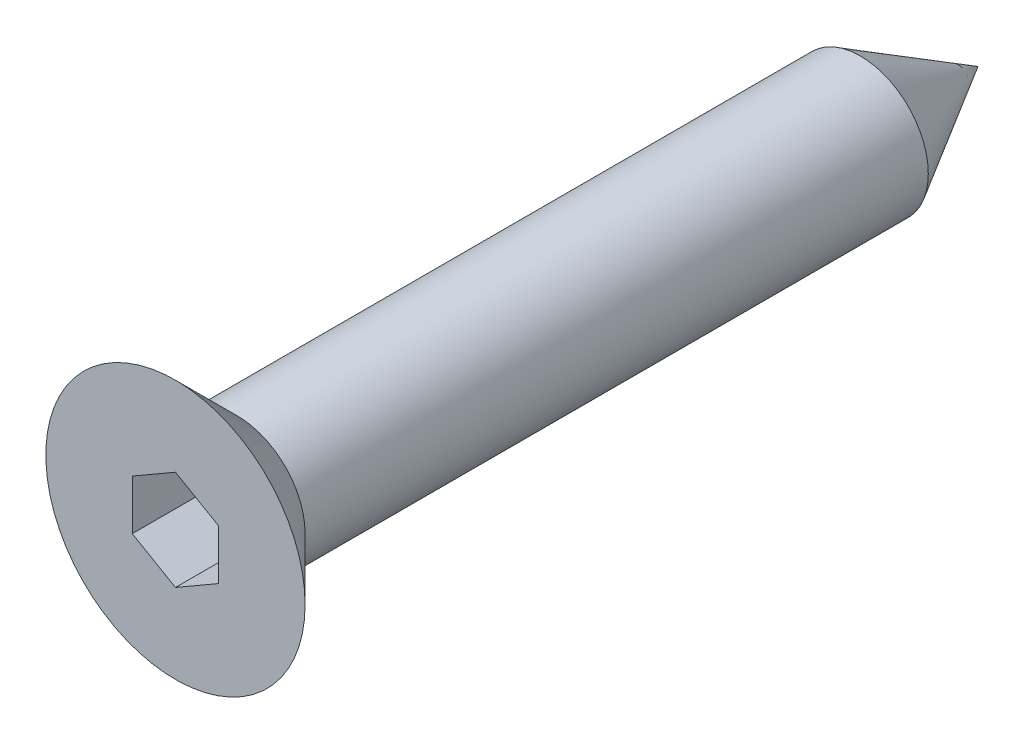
ISO-10303-21;
HEADER;
FILE_DESCRIPTION(('STEP AP214'),'2;1');
FILE_NAME('part.step','',(''),(''),'','','');
FILE_SCHEMA(('AUTOMOTIVE_DESIGN { 1 0 10303 214 1 1 1 1 }'));
ENDSEC;
DATA;
#1=APPLICATION_CONTEXT('core data for automotive mechanical design processes');
#2=APPLICATION_PROTOCOL_DEFINITION('international standard','automotive_design',2000,#1);
#3=PRODUCT_CONTEXT('',#1,'mechanical');
#4=PRODUCT('Part','Part','',(#3));
#5=PRODUCT_RELATED_PRODUCT_CATEGORY('part','',(#4));
#6=PRODUCT_DEFINITION_FORMATION('','',#4);
#7=PRODUCT_DEFINITION_CONTEXT('part definition',#1,'design');
#8=PRODUCT_DEFINITION('design','',#6,#7);
#9=PRODUCT_DEFINITION_SHAPE('','',#8);
#10=(LENGTH_UNIT() NAMED_UNIT(*) SI_UNIT(.MILLI.,.METRE.));
#11=(NAMED_UNIT(*) PLANE_ANGLE_UNIT() SI_UNIT($,.RADIAN.));
#12=(NAMED_UNIT(*) SI_UNIT($,.STERADIAN.) SOLID_ANGLE_UNIT());
#13=UNCERTAINTY_MEASURE_WITH_UNIT(LENGTH_MEASURE(1.E-05),#10,'distance_accuracy_value','');
#14=(GEOMETRIC_REPRESENTATION_CONTEXT(3) GLOBAL_UNCERTAINTY_ASSIGNED_CONTEXT((#13)) GLOBAL_UNIT_ASSIGNED_CONTEXT((#10,
#11,#12)) REPRESENTATION_CONTEXT('',''));
#15=CARTESIAN_POINT('',(0.,0.,0.));
#16=DIRECTION('',(0.,0.,1.));
#17=DIRECTION('',(1.,0.,0.));
#18=AXIS2_PLACEMENT_3D('',#15,#16,#17);
#19=CARTESIAN_POINT('',(0.,2.1,0.));
#20=DIRECTION('',(0.,0.,-1.));
#21=DIRECTION('',(-1.,0.,0.));
#22=AXIS2_PLACEMENT_3D('',#19,#20,#21);
#23=PLANE('',#22);
#24=DIRECTION('',(-0.866025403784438,-0.5,0.));
#25=VECTOR('',#24,1.);
#26=CARTESIAN_POINT('',(0.,0.808290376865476,0.));
#27=LINE('',#26,#25);
#28=CARTESIAN_POINT('',(0.,0.808290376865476,0.));
#29=VERTEX_POINT('',#28);
#30=CARTESIAN_POINT('',(-0.7,0.404145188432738,0.));
#31=VERTEX_POINT('',#30);
#32=EDGE_CURVE('E119',#29,#31,#27,.T.);
#33=ORIENTED_EDGE('',*,*,#32,.F.);
#34=DIRECTION('',(-0.866025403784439,0.5,0.));
#35=VECTOR('',#34,1.);
#36=CARTESIAN_POINT('',(0.699999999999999,0.404145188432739,0.));
#37=LINE('',#36,#35);
#38=CARTESIAN_POINT('',(0.699999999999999,0.404145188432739,0.));
#39=VERTEX_POINT('',#38);
#40=EDGE_CURVE('E49',#39,#29,#37,.T.);
#41=ORIENTED_EDGE('',*,*,#40,.F.);
#42=DIRECTION('',(0.,1.,0.));
#43=VECTOR('',#42,1.);
#44=CARTESIAN_POINT('',(0.7,-0.404145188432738,0.));
#45=LINE('',#44,#43);
#46=CARTESIAN_POINT('',(0.7,-0.404145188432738,0.));
#47=VERTEX_POINT('',#46);
#48=EDGE_CURVE('E105',#47,#39,#45,.T.);
#49=ORIENTED_EDGE('',*,*,#48,.F.);
#50=DIRECTION('',(0.866025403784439,0.5,0.));
#51=VECTOR('',#50,1.);
#52=CARTESIAN_POINT('',(0.,-0.808290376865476,0.));
#53=LINE('',#52,#51);
#54=CARTESIAN_POINT('',(0.,-0.808290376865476,0.));
#55=VERTEX_POINT('',#54);
#56=EDGE_CURVE('E108',#55,#47,#53,.T.);
#57=ORIENTED_EDGE('',*,*,#56,.F.);
#58=DIRECTION('',(0.866025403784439,-0.5,0.));
#59=VECTOR('',#58,1.);
#60=CARTESIAN_POINT('',(-0.7,-0.404145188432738,0.));
#61=LINE('',#60,#59);
#62=CARTESIAN_POINT('',(-0.7,-0.404145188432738,0.));
#63=VERTEX_POINT('',#62);
#64=EDGE_CURVE('E124',#63,#55,#61,.T.);
#65=ORIENTED_EDGE('',*,*,#64,.F.);
#66=DIRECTION('',(0.,-1.,0.));
#67=VECTOR('',#66,1.);
#68=CARTESIAN_POINT('',(-0.7,0.404145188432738,0.));
#69=LINE('',#68,#67);
#70=EDGE_CURVE('E121',#31,#63,#69,.T.);
#71=ORIENTED_EDGE('',*,*,#70,.F.);
#72=EDGE_LOOP('',(#33,#41,#49,#57,#65,#71));
#73=FACE_BOUND('',#72,.T.);
#74=CARTESIAN_POINT('',(0.,0.,0.));
#75=DIRECTION('',(0.,0.,1.));
#76=DIRECTION('',(1.,0.,0.));
#77=AXIS2_PLACEMENT_3D('',#74,#75,#76);
#78=CIRCLE('',#77,2.1);
#79=CARTESIAN_POINT('',(2.1,0.,0.));
#80=VERTEX_POINT('',#79);
#81=EDGE_CURVE('E42',#80,#80,#78,.T.);
#82=ORIENTED_EDGE('',*,*,#81,.T.);
#83=EDGE_LOOP('',(#82));
#84=FACE_BOUND('',#83,.T.);
#85=ADVANCED_FACE('F33',(#73,#84),#23,.F.);
#86=CARTESIAN_POINT('',(0.,0.,-1.));
#87=DIRECTION('',(0.,0.,1.));
#88=DIRECTION('',(1.,0.,0.));
#89=AXIS2_PLACEMENT_3D('',#86,#87,#88);
#90=CONICAL_SURFACE('',#89,1.1,0.785398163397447);
#91=ORIENTED_EDGE('',*,*,#81,.F.);
#92=EDGE_LOOP('',(#91));
#93=FACE_BOUND('',#92,.T.);
#94=CARTESIAN_POINT('',(0.,0.,-1.));
#95=DIRECTION('',(0.,0.,1.));
#96=DIRECTION('',(1.,0.,0.));
#97=AXIS2_PLACEMENT_3D('',#94,#95,#96);
#98=CIRCLE('',#97,1.1);
#99=CARTESIAN_POINT('',(1.1,0.,-1.));
#100=VERTEX_POINT('',#99);
#101=EDGE_CURVE('E131',#100,#100,#98,.T.);
#102=ORIENTED_EDGE('',*,*,#101,.T.);
#103=EDGE_LOOP('',(#102));
#104=FACE_BOUND('',#103,.T.);
#105=ADVANCED_FACE('F144',(#93,#104),#90,.T.);
#106=CARTESIAN_POINT('',(0.,0.,-13.));
#107=DIRECTION('',(0.,0.,1.));
#108=DIRECTION('',(1.,0.,0.));
#109=AXIS2_PLACEMENT_3D('',#106,#107,#108);
#110=CYLINDRICAL_SURFACE('',#109,1.1);
#111=CARTESIAN_POINT('',(0.,0.,-11.0947441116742));
#112=DIRECTION('',(0.,0.,1.));
#113=DIRECTION('',(1.,0.,0.));
#114=AXIS2_PLACEMENT_3D('',#111,#112,#113);
#115=CIRCLE('',#114,1.1);
#116=CARTESIAN_POINT('',(1.1,0.,-11.0947441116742));
#117=VERTEX_POINT('',#116);
#118=EDGE_CURVE('E11',#117,#117,#115,.T.);
#119=CARTESIAN_POINT('',(1.1,0.,-11.0947441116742));
#120=CARTESIAN_POINT('',(1.1,0.,-10.9895905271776));
#121=CARTESIAN_POINT('',(1.1,0.,-10.884436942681));
#122=CARTESIAN_POINT('',(1.1,0.,-10.6741297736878));
#123=CARTESIAN_POINT('',(1.1,0.,-10.5689761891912));
#124=CARTESIAN_POINT('',(1.1,0.,-10.358669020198));
#125=CARTESIAN_POINT('',(1.1,0.,-10.2535154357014));
#126=CARTESIAN_POINT('',(1.1,0.,-10.0432082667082));
#127=CARTESIAN_POINT('',(1.1,0.,-9.93805468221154));
#128=CARTESIAN_POINT('',(1.1,0.,-9.72774751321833));
#129=CARTESIAN_POINT('',(1.1,0.,-9.62259392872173));
#130=CARTESIAN_POINT('',(1.1,0.,-9.41228675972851));
#131=CARTESIAN_POINT('',(1.1,0.,-9.30713317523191));
#132=CARTESIAN_POINT('',(1.1,0.,-9.09682600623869));
#133=CARTESIAN_POINT('',(1.1,0.,-8.99167242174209));
#134=CARTESIAN_POINT('',(1.1,0.,-8.78136525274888));
#135=CARTESIAN_POINT('',(1.1,0.,-8.67621166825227));
#136=CARTESIAN_POINT('',(1.1,0.,-8.46590449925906));
#137=CARTESIAN_POINT('',(1.1,0.,-8.36075091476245));
#138=CARTESIAN_POINT('',(1.1,0.,-8.15044374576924));
#139=CARTESIAN_POINT('',(1.1,0.,-8.04529016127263));
#140=CARTESIAN_POINT('',(1.1,0.,-7.83498299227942));
#141=CARTESIAN_POINT('',(1.1,0.,-7.72982940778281));
#142=CARTESIAN_POINT('',(1.1,0.,-7.5195222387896));
#143=CARTESIAN_POINT('',(1.1,0.,-7.41436865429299));
#144=CARTESIAN_POINT('',(1.1,0.,-7.20406148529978));
#145=CARTESIAN_POINT('',(1.1,0.,-7.09890790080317));
#146=CARTESIAN_POINT('',(1.1,0.,-6.88860073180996));
#147=CARTESIAN_POINT('',(1.1,0.,-6.78344714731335));
#148=CARTESIAN_POINT('',(1.1,0.,-6.57313997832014));
#149=CARTESIAN_POINT('',(1.1,0.,-6.46798639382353));
#150=CARTESIAN_POINT('',(1.1,0.,-6.25767922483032));
#151=CARTESIAN_POINT('',(1.1,0.,-6.15252564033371));
#152=CARTESIAN_POINT('',(1.1,0.,-5.9422184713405));
#153=CARTESIAN_POINT('',(1.1,0.,-5.8370648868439));
#154=CARTESIAN_POINT('',(1.1,0.,-5.62675771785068));
#155=CARTESIAN_POINT('',(1.1,0.,-5.52160413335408));
#156=CARTESIAN_POINT('',(1.1,0.,-5.31129696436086));
#157=CARTESIAN_POINT('',(1.1,0.,-5.20614337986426));
#158=CARTESIAN_POINT('',(1.1,0.,-4.99583621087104));
#159=CARTESIAN_POINT('',(1.1,0.,-4.89068262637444));
#160=CARTESIAN_POINT('',(1.1,0.,-4.68037545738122));
#161=CARTESIAN_POINT('',(1.1,0.,-4.57522187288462));
#162=CARTESIAN_POINT('',(1.1,0.,-4.36491470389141));
#163=CARTESIAN_POINT('',(1.1,0.,-4.2597611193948));
#164=CARTESIAN_POINT('',(1.1,0.,-4.04945395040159));
#165=CARTESIAN_POINT('',(1.1,0.,-3.94430036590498));
#166=CARTESIAN_POINT('',(1.1,0.,-3.73399319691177));
#167=CARTESIAN_POINT('',(1.1,0.,-3.62883961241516));
#168=CARTESIAN_POINT('',(1.1,0.,-3.41853244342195));
#169=CARTESIAN_POINT('',(1.1,0.,-3.31337885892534));
#170=CARTESIAN_POINT('',(1.1,0.,-3.10307168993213));
#171=CARTESIAN_POINT('',(1.1,0.,-2.99791810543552));
#172=CARTESIAN_POINT('',(1.1,0.,-2.78761093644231));
#173=CARTESIAN_POINT('',(1.1,0.,-2.6824573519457));
#174=CARTESIAN_POINT('',(1.1,0.,-2.47215018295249));
#175=CARTESIAN_POINT('',(1.1,0.,-2.36699659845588));
#176=CARTESIAN_POINT('',(1.1,0.,-2.15668942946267));
#177=CARTESIAN_POINT('',(1.1,0.,-2.05153584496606));
#178=CARTESIAN_POINT('',(1.1,0.,-1.84122867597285));
#179=CARTESIAN_POINT('',(1.1,0.,-1.73607509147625));
#180=CARTESIAN_POINT('',(1.1,0.,-1.52576792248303));
#181=CARTESIAN_POINT('',(1.1,0.,-1.42061433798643));
#182=CARTESIAN_POINT('',(1.1,0.,-1.21030716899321));
#183=CARTESIAN_POINT('',(1.1,0.,-1.10515358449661));
#184=CARTESIAN_POINT('',(1.1,0.,-1.));
#185=B_SPLINE_CURVE_WITH_KNOTS('',3,(#119,#120,#121,#122,#123,#124,#125,#126,#127,#128,#129,
#130,#131,#132,#133,#134,#135,#136,#137,#138,#139,#140,#141,#142,#143,#144,#145,#146,#147,#148,
#149,#150,#151,#152,#153,#154,#155,#156,#157,#158,#159,#160,#161,#162,#163,#164,#165,#166,#167,
#168,#169,#170,#171,#172,#173,#174,#175,#176,#177,#178,#179,#180,#181,#182,#183,#184),
.UNSPECIFIED.,.F.,.F.,(4,2,2,2,2,2,2,2,2,2,2,2,2,2,2,2,2,2,2,2,2,2,2,2,2,2,2,2,2,2,2,2,4),(0.,
0.315460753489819,0.630921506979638,0.946382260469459,1.26184301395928,1.5773037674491,
1.89276452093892,2.20822527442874,2.52368602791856,2.83914678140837,3.15460753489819,
3.47006828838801,3.78552904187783,4.10098979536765,4.41645054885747,4.73191130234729,
5.04737205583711,5.36283280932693,5.67829356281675,5.99375431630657,6.30921506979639,
6.6246758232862,6.94013657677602,7.25559733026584,7.57105808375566,7.88651883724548,
8.2019795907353,8.51744034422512,8.83290109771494,9.14836185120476,9.46382260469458,
9.7792833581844,10.0947441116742),.UNSPECIFIED.);
#186=EDGE_CURVE('BSEAM147',#117,#100,#185,.T.);
#187=ORIENTED_EDGE('',*,*,#118,.T.);
#188=ORIENTED_EDGE('',*,*,#101,.F.);
#189=ORIENTED_EDGE('',*,*,#186,.T.);
#190=ORIENTED_EDGE('',*,*,#186,.F.);
#191=EDGE_LOOP('',(#187,#189,#188,#190));
#192=FACE_BOUND('',#191,.T.);
#193=ADVANCED_FACE('F147',(#192),#110,.T.);
#194=CARTESIAN_POINT('',(0.699999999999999,0.404145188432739,-1.5));
#195=DIRECTION('',(0.5,0.866025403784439,0.));
#196=DIRECTION('',(-0.866025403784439,0.5,0.));
#197=AXIS2_PLACEMENT_3D('',#194,#195,#196);
#198=PLANE('',#197);
#199=ORIENTED_EDGE('',*,*,#40,.T.);
#200=DIRECTION('',(0.,0.,1.));
#201=VECTOR('',#200,1.);
#202=CARTESIAN_POINT('',(0.,0.808290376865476,-1.5));
#203=LINE('',#202,#201);
#204=CARTESIAN_POINT('',(0.,0.808290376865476,-1.5));
#205=VERTEX_POINT('',#204);
#206=EDGE_CURVE('E82',#205,#29,#203,.T.);
#207=ORIENTED_EDGE('',*,*,#206,.F.);
#208=DIRECTION('',(-0.866025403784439,0.5,0.));
#209=VECTOR('',#208,1.);
#210=CARTESIAN_POINT('',(0.699999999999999,0.404145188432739,-1.5));
#211=LINE('',#210,#209);
#212=CARTESIAN_POINT('',(0.699999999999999,0.404145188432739,-1.5));
#213=VERTEX_POINT('',#212);
#214=EDGE_CURVE('E86',#213,#205,#211,.T.);
#215=ORIENTED_EDGE('',*,*,#214,.F.);
#216=DIRECTION('',(0.,0.,1.));
#217=VECTOR('',#216,1.);
#218=CARTESIAN_POINT('',(0.699999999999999,0.404145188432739,-1.5));
#219=LINE('',#218,#217);
#220=EDGE_CURVE('E129',#213,#39,#219,.T.);
#221=ORIENTED_EDGE('',*,*,#220,.T.);
#222=EDGE_LOOP('',(#199,#207,#215,#221));
#223=FACE_BOUND('',#222,.T.);
#224=ADVANCED_FACE('F84',(#223),#198,.F.);
#225=CARTESIAN_POINT('',(0.7,-0.404145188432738,-1.5));
#226=DIRECTION('',(1.,0.,0.));
#227=DIRECTION('',(0.,1.,0.));
#228=AXIS2_PLACEMENT_3D('',#225,#226,#227);
#229=PLANE('',#228);
#230=ORIENTED_EDGE('',*,*,#48,.T.);
#231=ORIENTED_EDGE('',*,*,#220,.F.);
#232=DIRECTION('',(0.,1.,0.));
#233=VECTOR('',#232,1.);
#234=CARTESIAN_POINT('',(0.7,-0.404145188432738,-1.5));
#235=LINE('',#234,#233);
#236=CARTESIAN_POINT('',(0.7,-0.404145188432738,-1.5));
#237=VERTEX_POINT('',#236);
#238=EDGE_CURVE('E92',#237,#213,#235,.T.);
#239=ORIENTED_EDGE('',*,*,#238,.F.);
#240=DIRECTION('',(0.,0.,1.));
#241=VECTOR('',#240,1.);
#242=CARTESIAN_POINT('',(0.7,-0.404145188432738,-1.5));
#243=LINE('',#242,#241);
#244=EDGE_CURVE('E132',#237,#47,#243,.T.);
#245=ORIENTED_EDGE('',*,*,#244,.T.);
#246=EDGE_LOOP('',(#230,#231,#239,#245));
#247=FACE_BOUND('',#246,.T.);
#248=ADVANCED_FACE('F157',(#247),#229,.F.);
#249=CARTESIAN_POINT('',(0.,-0.808290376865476,-1.5));
#250=DIRECTION('',(0.5,-0.866025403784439,0.));
#251=DIRECTION('',(0.866025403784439,0.5,0.));
#252=AXIS2_PLACEMENT_3D('',#249,#250,#251);
#253=PLANE('',#252);
#254=ORIENTED_EDGE('',*,*,#56,.T.);
#255=ORIENTED_EDGE('',*,*,#244,.F.);
#256=DIRECTION('',(0.866025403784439,0.5,0.));
#257=VECTOR('',#256,1.);
#258=CARTESIAN_POINT('',(0.,-0.808290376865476,-1.5));
#259=LINE('',#258,#257);
#260=CARTESIAN_POINT('',(0.,-0.808290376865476,-1.5));
#261=VERTEX_POINT('',#260);
#262=EDGE_CURVE('E115',#261,#237,#259,.T.);
#263=ORIENTED_EDGE('',*,*,#262,.F.);
#264=DIRECTION('',(0.,0.,1.));
#265=VECTOR('',#264,1.);
#266=CARTESIAN_POINT('',(0.,-0.808290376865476,-1.5));
#267=LINE('',#266,#265);
#268=EDGE_CURVE('E134',#261,#55,#267,.T.);
#269=ORIENTED_EDGE('',*,*,#268,.T.);
#270=EDGE_LOOP('',(#254,#255,#263,#269));
#271=FACE_BOUND('',#270,.T.);
#272=ADVANCED_FACE('F174',(#271),#253,.F.);
#273=CARTESIAN_POINT('',(-0.7,-0.404145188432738,-1.5));
#274=DIRECTION('',(-0.5,-0.866025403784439,0.));
#275=DIRECTION('',(0.866025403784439,-0.5,0.));
#276=AXIS2_PLACEMENT_3D('',#273,#274,#275);
#277=PLANE('',#276);
#278=ORIENTED_EDGE('',*,*,#64,.T.);
#279=ORIENTED_EDGE('',*,*,#268,.F.);
#280=DIRECTION('',(0.866025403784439,-0.5,0.));
#281=VECTOR('',#280,1.);
#282=CARTESIAN_POINT('',(-0.7,-0.404145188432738,-1.5));
#283=LINE('',#282,#281);
#284=CARTESIAN_POINT('',(-0.7,-0.404145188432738,-1.5));
#285=VERTEX_POINT('',#284);
#286=EDGE_CURVE('E112',#285,#261,#283,.T.);
#287=ORIENTED_EDGE('',*,*,#286,.F.);
#288=DIRECTION('',(0.,0.,1.));
#289=VECTOR('',#288,1.);
#290=CARTESIAN_POINT('',(-0.7,-0.404145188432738,-1.5));
#291=LINE('',#290,#289);
#292=EDGE_CURVE('E136',#285,#63,#291,.T.);
#293=ORIENTED_EDGE('',*,*,#292,.T.);
#294=EDGE_LOOP('',(#278,#279,#287,#293));
#295=FACE_BOUND('',#294,.T.);
#296=ADVANCED_FACE('F172',(#295),#277,.F.);
#297=CARTESIAN_POINT('',(-0.7,0.404145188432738,-1.5));
#298=DIRECTION('',(-1.,0.,0.));
#299=DIRECTION('',(0.,-1.,0.));
#300=AXIS2_PLACEMENT_3D('',#297,#298,#299);
#301=PLANE('',#300);
#302=ORIENTED_EDGE('',*,*,#70,.T.);
#303=ORIENTED_EDGE('',*,*,#292,.F.);
#304=DIRECTION('',(0.,-1.,0.));
#305=VECTOR('',#304,1.);
#306=CARTESIAN_POINT('',(-0.7,0.404145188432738,-1.5));
#307=LINE('',#306,#305);
#308=CARTESIAN_POINT('',(-0.7,0.404145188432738,-1.5));
#309=VERTEX_POINT('',#308);
#310=EDGE_CURVE('E100',#309,#285,#307,.T.);
#311=ORIENTED_EDGE('',*,*,#310,.F.);
#312=DIRECTION('',(0.,0.,1.));
#313=VECTOR('',#312,1.);
#314=CARTESIAN_POINT('',(-0.7,0.404145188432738,-1.5));
#315=LINE('',#314,#313);
#316=EDGE_CURVE('E91',#309,#31,#315,.T.);
#317=ORIENTED_EDGE('',*,*,#316,.T.);
#318=EDGE_LOOP('',(#302,#303,#311,#317));
#319=FACE_BOUND('',#318,.T.);
#320=ADVANCED_FACE('F168',(#319),#301,.F.);
#321=CARTESIAN_POINT('',(0.,0.808290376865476,-1.5));
#322=DIRECTION('',(-0.5,0.866025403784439,0.));
#323=DIRECTION('',(-0.866025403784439,-0.5,0.));
#324=AXIS2_PLACEMENT_3D('',#321,#322,#323);
#325=PLANE('',#324);
#326=ORIENTED_EDGE('',*,*,#32,.T.);
#327=ORIENTED_EDGE('',*,*,#316,.F.);
#328=DIRECTION('',(-0.866025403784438,-0.5,0.));
#329=VECTOR('',#328,1.);
#330=CARTESIAN_POINT('',(0.,0.808290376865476,-1.5));
#331=LINE('',#330,#329);
#332=EDGE_CURVE('E95',#205,#309,#331,.T.);
#333=ORIENTED_EDGE('',*,*,#332,.F.);
#334=ORIENTED_EDGE('',*,*,#206,.T.);
#335=EDGE_LOOP('',(#326,#327,#333,#334));
#336=FACE_BOUND('',#335,.T.);
#337=ADVANCED_FACE('F96',(#336),#325,.F.);
#338=CARTESIAN_POINT('',(0.,0.808290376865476,-1.5));
#339=DIRECTION('',(0.,0.,1.));
#340=DIRECTION('',(1.,0.,0.));
#341=AXIS2_PLACEMENT_3D('',#338,#339,#340);
#342=PLANE('',#341);
#343=ORIENTED_EDGE('',*,*,#214,.T.);
#344=ORIENTED_EDGE('',*,*,#332,.T.);
#345=ORIENTED_EDGE('',*,*,#310,.T.);
#346=ORIENTED_EDGE('',*,*,#286,.T.);
#347=ORIENTED_EDGE('',*,*,#262,.T.);
#348=ORIENTED_EDGE('',*,*,#238,.T.);
#349=EDGE_LOOP('',(#343,#344,#345,#346,#347,#348));
#350=FACE_BOUND('',#349,.T.);
#351=ADVANCED_FACE('F102',(#350),#342,.T.);
#352=CARTESIAN_POINT('',(0.,0.,-11.0947441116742));
#353=DIRECTION('',(0.,0.,1.));
#354=DIRECTION('',(1.,0.,0.));
#355=AXIS2_PLACEMENT_3D('',#352,#353,#354);
#356=CONICAL_SURFACE('',#355,1.10000000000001,0.5235987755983);
#357=CARTESIAN_POINT('',(0.,0.,-13.));
#358=VERTEX_POINT('',#357);
#359=VERTEX_LOOP('',#358);
#360=FACE_BOUND('',#359,.T.);
#361=ORIENTED_EDGE('',*,*,#118,.F.);
#362=EDGE_LOOP('',(#361));
#363=FACE_BOUND('',#362,.T.);
#364=ADVANCED_FACE('F35',(#360,#363),#356,.T.);
#365=CLOSED_SHELL('',(#85,#105,#193,#224,#248,#272,#296,#320,#337,#351,#364));
#366=MANIFOLD_SOLID_BREP('B2',#365);
#367=ADVANCED_BREP_SHAPE_REPRESENTATION('',(#18,#366),#14);
#368=SHAPE_DEFINITION_REPRESENTATION(#9,#367);
ENDSEC;
END-ISO-10303-21;
